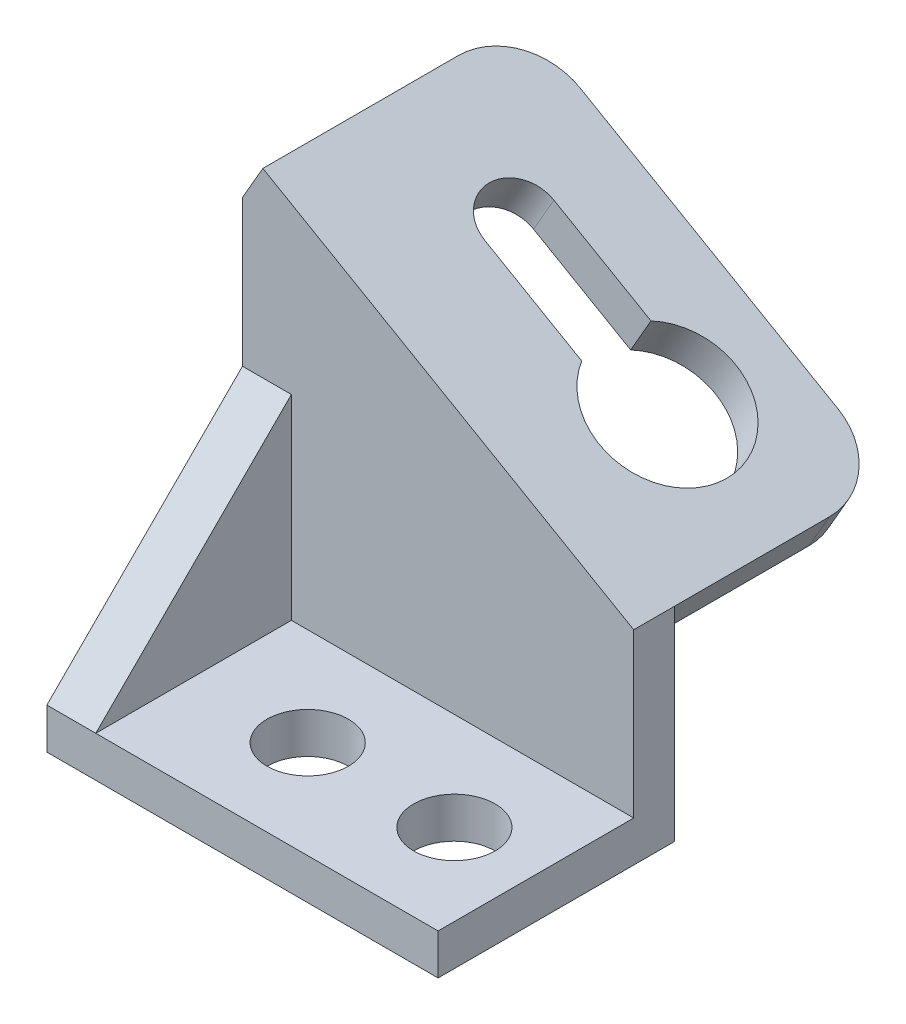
ISO-10303-21;
HEADER;
FILE_DESCRIPTION(('STEP AP214'),'2;1');
FILE_NAME('part.step','',(''),(''),'','','');
FILE_SCHEMA(('AUTOMOTIVE_DESIGN { 1 0 10303 214 1 1 1 1 }'));
ENDSEC;
DATA;
#1=APPLICATION_CONTEXT('core data for automotive mechanical design processes');
#2=APPLICATION_PROTOCOL_DEFINITION('international standard','automotive_design',2000,#1);
#3=PRODUCT_CONTEXT('',#1,'mechanical');
#4=PRODUCT('Part','Part','',(#3));
#5=PRODUCT_RELATED_PRODUCT_CATEGORY('part','',(#4));
#6=PRODUCT_DEFINITION_FORMATION('','',#4);
#7=PRODUCT_DEFINITION_CONTEXT('part definition',#1,'design');
#8=PRODUCT_DEFINITION('design','',#6,#7);
#9=PRODUCT_DEFINITION_SHAPE('','',#8);
#10=(LENGTH_UNIT() NAMED_UNIT(*) SI_UNIT(.MILLI.,.METRE.));
#11=(NAMED_UNIT(*) PLANE_ANGLE_UNIT() SI_UNIT($,.RADIAN.));
#12=(NAMED_UNIT(*) SI_UNIT($,.STERADIAN.) SOLID_ANGLE_UNIT());
#13=UNCERTAINTY_MEASURE_WITH_UNIT(LENGTH_MEASURE(1.E-05),#10,'distance_accuracy_value','');
#14=(GEOMETRIC_REPRESENTATION_CONTEXT(3) GLOBAL_UNCERTAINTY_ASSIGNED_CONTEXT((#13)) GLOBAL_UNIT_ASSIGNED_CONTEXT((#10,
#11,#12)) REPRESENTATION_CONTEXT('',''));
#15=CARTESIAN_POINT('',(0.,0.,0.));
#16=DIRECTION('',(0.,0.,1.));
#17=DIRECTION('',(1.,0.,0.));
#18=AXIS2_PLACEMENT_3D('',#15,#16,#17);
#19=CARTESIAN_POINT('',(32.7981532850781,56.8080678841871,0.));
#20=DIRECTION('',(0.500000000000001,0.866025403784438,0.));
#21=DIRECTION('',(-0.866025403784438,0.500000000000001,0.));
#22=AXIS2_PLACEMENT_3D('',#19,#20,#21);
#23=PLANE('',#22);
#24=DIRECTION('',(0.866025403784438,-0.500000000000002,0.));
#25=VECTOR('',#24,1.);
#26=CARTESIAN_POINT('',(-1.17961196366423E-13,75.7440905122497,-50.8));
#27=LINE('',#26,#25);
#28=CARTESIAN_POINT('',(14.9672726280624,67.1027316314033,-50.8));
#29=VERTEX_POINT('',#28);
#30=CARTESIAN_POINT('',(65.2014773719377,38.1,-50.8));
#31=VERTEX_POINT('',#30);
#32=EDGE_CURVE('E198',#29,#31,#27,.T.);
#33=ORIENTED_EDGE('',*,*,#32,.F.);
#34=CARTESIAN_POINT('',(14.9672726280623,67.1027316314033,-38.1));
#35=DIRECTION('',(0.500000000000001,0.866025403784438,0.));
#36=DIRECTION('',(-0.866025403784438,0.500000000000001,0.));
#37=AXIS2_PLACEMENT_3D('',#34,#35,#36);
#38=CIRCLE('',#37,12.7);
#39=CARTESIAN_POINT('',(3.96874999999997,73.4527316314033,-38.1));
#40=VERTEX_POINT('',#39);
#41=EDGE_CURVE('E270',#29,#40,#38,.T.);
#42=ORIENTED_EDGE('',*,*,#41,.T.);
#43=DIRECTION('',(0.,0.,-1.));
#44=VECTOR('',#43,1.);
#45=CARTESIAN_POINT('',(3.96874999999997,73.4527316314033,0.));
#46=LINE('',#45,#44);
#47=CARTESIAN_POINT('',(3.96874999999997,73.4527316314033,0.));
#48=VERTEX_POINT('',#47);
#49=EDGE_CURVE('E192',#48,#40,#46,.T.);
#50=ORIENTED_EDGE('',*,*,#49,.F.);
#51=DIRECTION('',(0.866025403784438,-0.500000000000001,0.));
#52=VECTOR('',#51,1.);
#53=CARTESIAN_POINT('',(-26.2151226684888,90.8793986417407,0.));
#54=LINE('',#53,#52);
#55=CARTESIAN_POINT('',(76.2,31.75,0.));
#56=VERTEX_POINT('',#55);
#57=EDGE_CURVE('E212',#48,#56,#54,.T.);
#58=ORIENTED_EDGE('',*,*,#57,.T.);
#59=DIRECTION('',(0.,0.,-1.));
#60=VECTOR('',#59,1.);
#61=CARTESIAN_POINT('',(76.2,31.75,0.));
#62=LINE('',#61,#60);
#63=CARTESIAN_POINT('',(76.2,31.75,-7.9375));
#64=VERTEX_POINT('',#63);
#65=EDGE_CURVE('E236',#56,#64,#62,.T.);
#66=ORIENTED_EDGE('',*,*,#65,.T.);
#67=DIRECTION('',(0.,0.,-1.));
#68=VECTOR('',#67,1.);
#69=CARTESIAN_POINT('',(76.2,31.75,0.));
#70=LINE('',#69,#68);
#71=CARTESIAN_POINT('',(76.2000000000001,31.75,-38.1));
#72=VERTEX_POINT('',#71);
#73=EDGE_CURVE('E195',#64,#72,#70,.T.);
#74=ORIENTED_EDGE('',*,*,#73,.T.);
#75=CARTESIAN_POINT('',(65.2014773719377,38.1,-38.1));
#76=DIRECTION('',(0.500000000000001,0.866025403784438,0.));
#77=DIRECTION('',(-0.866025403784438,0.500000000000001,0.));
#78=AXIS2_PLACEMENT_3D('',#75,#76,#77);
#79=CIRCLE('',#78,12.7);
#80=EDGE_CURVE('E268',#72,#31,#79,.T.);
#81=ORIENTED_EDGE('',*,*,#80,.T.);
#82=EDGE_LOOP('',(#33,#42,#50,#58,#66,#74,#81));
#83=FACE_BOUND('',#82,.T.);
#84=DIRECTION('',(0.866025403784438,-0.500000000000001,0.));
#85=VECTOR('',#84,1.);
#86=CARTESIAN_POINT('',(25.3318328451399,61.1187499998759,-21.828125));
#87=LINE('',#86,#85);
#88=CARTESIAN_POINT('',(25.3318328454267,61.1187499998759,-21.828125));
#89=VERTEX_POINT('',#88);
#90=CARTESIAN_POINT('',(44.2417084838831,50.2011282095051,-21.828125));
#91=VERTEX_POINT('',#90);
#92=EDGE_CURVE('E161',#89,#91,#87,.T.);
#93=ORIENTED_EDGE('',*,*,#92,.F.);
#94=CARTESIAN_POINT('',(25.3318328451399,61.1187499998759,-28.575));
#95=DIRECTION('',(-0.500000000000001,-0.866025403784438,0.));
#96=DIRECTION('',(0.866025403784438,-0.500000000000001,0.));
#97=AXIS2_PLACEMENT_3D('',#94,#95,#96);
#98=CIRCLE('',#97,6.74687499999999);
#99=CARTESIAN_POINT('',(25.3318328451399,61.1187499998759,-35.321875));
#100=VERTEX_POINT('',#99);
#101=EDGE_CURVE('E43',#89,#100,#98,.T.);
#102=ORIENTED_EDGE('',*,*,#101,.T.);
#103=DIRECTION('',(0.866025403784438,-0.500000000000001,0.));
#104=VECTOR('',#103,1.);
#105=CARTESIAN_POINT('',(25.3318328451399,61.1187499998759,-35.321875));
#106=LINE('',#105,#104);
#107=CARTESIAN_POINT('',(44.2417084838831,50.2011282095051,-35.321875));
#108=VERTEX_POINT('',#107);
#109=EDGE_CURVE('E152',#100,#108,#106,.T.);
#110=ORIENTED_EDGE('',*,*,#109,.T.);
#111=CARTESIAN_POINT('',(54.2029547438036,44.4499999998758,-28.575));
#112=DIRECTION('',(-0.500000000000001,-0.866025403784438,0.));
#113=DIRECTION('',(0.866025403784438,-0.500000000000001,0.));
#114=AXIS2_PLACEMENT_3D('',#111,#112,#113);
#115=CIRCLE('',#114,13.335);
#116=EDGE_CURVE('E158',#108,#91,#115,.T.);
#117=ORIENTED_EDGE('',*,*,#116,.T.);
#118=EDGE_LOOP('',(#93,#102,#110,#117));
#119=FACE_BOUND('',#118,.T.);
#120=ADVANCED_FACE('F28',(#83,#119),#23,.T.);
#121=CARTESIAN_POINT('',(72.23125,24.875923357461,0.));
#122=DIRECTION('',(0.500000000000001,0.866025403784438,0.));
#123=DIRECTION('',(-0.866025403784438,0.500000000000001,0.));
#124=AXIS2_PLACEMENT_3D('',#121,#122,#123);
#125=PLANE('',#124);
#126=DIRECTION('',(0.,0.,1.));
#127=VECTOR('',#126,1.);
#128=CARTESIAN_POINT('',(0.,66.5786549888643,0.));
#129=LINE('',#128,#127);
#130=CARTESIAN_POINT('',(0.,66.5786549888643,-38.1));
#131=VERTEX_POINT('',#130);
#132=CARTESIAN_POINT('',(0.,66.5786549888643,-7.9375));
#133=VERTEX_POINT('',#132);
#134=EDGE_CURVE('E255',#131,#133,#129,.T.);
#135=ORIENTED_EDGE('',*,*,#134,.F.);
#136=CARTESIAN_POINT('',(10.9985226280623,60.2286549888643,-38.1));
#137=DIRECTION('',(0.500000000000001,0.866025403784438,0.));
#138=DIRECTION('',(-0.866025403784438,0.500000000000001,0.));
#139=AXIS2_PLACEMENT_3D('',#136,#137,#138);
#140=CIRCLE('',#139,12.7);
#141=CARTESIAN_POINT('',(10.9985226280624,60.2286549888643,-50.8));
#142=VERTEX_POINT('',#141);
#143=EDGE_CURVE('E262',#131,#142,#140,.F.);
#144=ORIENTED_EDGE('',*,*,#143,.T.);
#145=DIRECTION('',(0.866025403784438,-0.500000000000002,0.));
#146=VECTOR('',#145,1.);
#147=CARTESIAN_POINT('',(-3.96875000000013,68.8700138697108,-50.8));
#148=LINE('',#147,#146);
#149=CARTESIAN_POINT('',(61.2327273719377,31.225923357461,-50.8));
#150=VERTEX_POINT('',#149);
#151=EDGE_CURVE('E204',#142,#150,#148,.T.);
#152=ORIENTED_EDGE('',*,*,#151,.T.);
#153=CARTESIAN_POINT('',(61.2327273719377,31.225923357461,-38.1));
#154=DIRECTION('',(0.500000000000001,0.866025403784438,0.));
#155=DIRECTION('',(-0.866025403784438,0.500000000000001,0.));
#156=AXIS2_PLACEMENT_3D('',#153,#154,#155);
#157=CIRCLE('',#156,12.7);
#158=CARTESIAN_POINT('',(72.23125,24.875923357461,-38.1));
#159=VERTEX_POINT('',#158);
#160=EDGE_CURVE('E260',#150,#159,#157,.F.);
#161=ORIENTED_EDGE('',*,*,#160,.T.);
#162=DIRECTION('',(0.,0.,-1.));
#163=VECTOR('',#162,1.);
#164=CARTESIAN_POINT('',(72.23125,24.875923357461,0.));
#165=LINE('',#164,#163);
#166=CARTESIAN_POINT('',(72.23125,24.875923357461,-7.9375));
#167=VERTEX_POINT('',#166);
#168=EDGE_CURVE('E201',#167,#159,#165,.T.);
#169=ORIENTED_EDGE('',*,*,#168,.F.);
#170=DIRECTION('',(0.866025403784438,-0.500000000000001,0.));
#171=VECTOR('',#170,1.);
#172=CARTESIAN_POINT('',(85.979403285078,16.938423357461,-7.9375));
#173=LINE('',#172,#171);
#174=EDGE_CURVE('E209',#133,#167,#173,.T.);
#175=ORIENTED_EDGE('',*,*,#174,.F.);
#176=EDGE_LOOP('',(#135,#144,#152,#161,#169,#175));
#177=FACE_BOUND('',#176,.T.);
#178=CARTESIAN_POINT('',(21.3630828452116,54.2446733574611,-28.575));
#179=DIRECTION('',(0.500000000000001,0.866025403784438,0.));
#180=DIRECTION('',(-0.866025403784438,0.500000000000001,0.));
#181=AXIS2_PLACEMENT_3D('',#178,#179,#180);
#182=CIRCLE('',#181,6.74687499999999);
#183=CARTESIAN_POINT('',(21.3630828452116,54.2446733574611,-21.828125));
#184=VERTEX_POINT('',#183);
#185=CARTESIAN_POINT('',(21.3630828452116,54.2446733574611,-35.321875));
#186=VERTEX_POINT('',#185);
#187=EDGE_CURVE('E11',#184,#186,#182,.F.);
#188=ORIENTED_EDGE('',*,*,#187,.F.);
#189=DIRECTION('',(0.866025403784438,-0.500000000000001,0.));
#190=VECTOR('',#189,1.);
#191=CARTESIAN_POINT('',(72.23125,24.875923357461,-21.828125));
#192=LINE('',#191,#190);
#193=CARTESIAN_POINT('',(40.2729584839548,43.3270515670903,-21.828125));
#194=VERTEX_POINT('',#193);
#195=EDGE_CURVE('E275',#184,#194,#192,.T.);
#196=ORIENTED_EDGE('',*,*,#195,.T.);
#197=CARTESIAN_POINT('',(50.2342047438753,37.5759233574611,-28.575));
#198=DIRECTION('',(0.500000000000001,0.866025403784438,0.));
#199=DIRECTION('',(-0.866025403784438,0.500000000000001,0.));
#200=AXIS2_PLACEMENT_3D('',#197,#198,#199);
#201=CIRCLE('',#200,13.335);
#202=CARTESIAN_POINT('',(40.2729584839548,43.3270515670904,-35.321875));
#203=VERTEX_POINT('',#202);
#204=EDGE_CURVE('E278',#203,#194,#201,.F.);
#205=ORIENTED_EDGE('',*,*,#204,.F.);
#206=DIRECTION('',(0.866025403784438,-0.500000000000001,0.));
#207=VECTOR('',#206,1.);
#208=CARTESIAN_POINT('',(72.23125,24.875923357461,-35.321875));
#209=LINE('',#208,#207);
#210=EDGE_CURVE('E36',#186,#203,#209,.T.);
#211=ORIENTED_EDGE('',*,*,#210,.F.);
#212=EDGE_LOOP('',(#188,#196,#205,#211));
#213=FACE_BOUND('',#212,.T.);
#214=ADVANCED_FACE('F283',(#177,#213),#125,.F.);
#215=CARTESIAN_POINT('',(76.2,0.,0.));
#216=DIRECTION('',(0.,0.,-1.));
#217=DIRECTION('',(-1.,0.,0.));
#218=AXIS2_PLACEMENT_3D('',#215,#216,#217);
#219=PLANE('',#218);
#220=DIRECTION('',(0.,-1.,0.));
#221=VECTOR('',#220,1.);
#222=CARTESIAN_POINT('',(0.,0.,0.));
#223=LINE('',#222,#221);
#224=CARTESIAN_POINT('',(0.,66.5786549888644,0.));
#225=VERTEX_POINT('',#224);
#226=CARTESIAN_POINT('',(0.,38.1,0.));
#227=VERTEX_POINT('',#226);
#228=EDGE_CURVE('E222',#225,#227,#223,.T.);
#229=ORIENTED_EDGE('',*,*,#228,.T.);
#230=DIRECTION('',(-1.,0.,0.));
#231=VECTOR('',#230,1.);
#232=CARTESIAN_POINT('',(9.525,38.1,0.));
#233=LINE('',#232,#231);
#234=CARTESIAN_POINT('',(9.525,38.1,0.));
#235=VERTEX_POINT('',#234);
#236=EDGE_CURVE('E186',#235,#227,#233,.T.);
#237=ORIENTED_EDGE('',*,*,#236,.F.);
#238=DIRECTION('',(0.,-1.,0.));
#239=VECTOR('',#238,1.);
#240=CARTESIAN_POINT('',(9.525,38.1,0.));
#241=LINE('',#240,#239);
#242=CARTESIAN_POINT('',(9.525,0.,0.));
#243=VERTEX_POINT('',#242);
#244=EDGE_CURVE('E182',#235,#243,#241,.T.);
#245=ORIENTED_EDGE('',*,*,#244,.T.);
#246=DIRECTION('',(-1.,0.,0.));
#247=VECTOR('',#246,1.);
#248=CARTESIAN_POINT('',(76.2,0.,0.));
#249=LINE('',#248,#247);
#250=CARTESIAN_POINT('',(76.2,0.,0.));
#251=VERTEX_POINT('',#250);
#252=EDGE_CURVE('E241',#251,#243,#249,.T.);
#253=ORIENTED_EDGE('',*,*,#252,.F.);
#254=DIRECTION('',(0.,-1.,0.));
#255=VECTOR('',#254,1.);
#256=CARTESIAN_POINT('',(76.2,0.,0.));
#257=LINE('',#256,#255);
#258=EDGE_CURVE('E239',#56,#251,#257,.T.);
#259=ORIENTED_EDGE('',*,*,#258,.F.);
#260=ORIENTED_EDGE('',*,*,#57,.F.);
#261=DIRECTION('',(0.5,0.866025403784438,0.));
#262=VECTOR('',#261,1.);
#263=CARTESIAN_POINT('',(0.,66.5786549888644,0.));
#264=LINE('',#263,#262);
#265=EDGE_CURVE('E188',#225,#48,#264,.T.);
#266=ORIENTED_EDGE('',*,*,#265,.F.);
#267=EDGE_LOOP('',(#229,#237,#245,#253,#259,#260,#266));
#268=FACE_BOUND('',#267,.T.);
#269=ADVANCED_FACE('F303',(#268),#219,.F.);
#270=CARTESIAN_POINT('',(-3.96875000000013,68.8700138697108,-50.8));
#271=DIRECTION('',(0.,0.,1.));
#272=DIRECTION('',(1.,0.,0.));
#273=AXIS2_PLACEMENT_3D('',#270,#271,#272);
#274=PLANE('',#273);
#275=ORIENTED_EDGE('',*,*,#151,.F.);
#276=DIRECTION('',(-0.5,-0.866025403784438,0.));
#277=VECTOR('',#276,1.);
#278=CARTESIAN_POINT('',(14.9672726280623,67.1027316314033,-50.8));
#279=LINE('',#278,#277);
#280=EDGE_CURVE('E266',#142,#29,#279,.F.);
#281=ORIENTED_EDGE('',*,*,#280,.T.);
#282=ORIENTED_EDGE('',*,*,#32,.T.);
#283=DIRECTION('',(0.500000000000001,0.866025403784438,0.));
#284=VECTOR('',#283,1.);
#285=CARTESIAN_POINT('',(61.2327273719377,31.225923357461,-50.8));
#286=LINE('',#285,#284);
#287=EDGE_CURVE('E264',#31,#150,#286,.F.);
#288=ORIENTED_EDGE('',*,*,#287,.T.);
#289=EDGE_LOOP('',(#275,#281,#282,#288));
#290=FACE_BOUND('',#289,.T.);
#291=ADVANCED_FACE('F314',(#290),#274,.F.);
#292=CARTESIAN_POINT('',(0.,0.,38.1));
#293=DIRECTION('',(-1.,0.,0.));
#294=DIRECTION('',(0.,0.,1.));
#295=AXIS2_PLACEMENT_3D('',#292,#293,#294);
#296=PLANE('',#295);
#297=ORIENTED_EDGE('',*,*,#228,.F.);
#298=DIRECTION('',(0.,0.,-1.));
#299=VECTOR('',#298,1.);
#300=CARTESIAN_POINT('',(0.,66.5786549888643,38.1));
#301=LINE('',#300,#299);
#302=EDGE_CURVE('E252',#225,#133,#301,.T.);
#303=ORIENTED_EDGE('',*,*,#302,.T.);
#304=DIRECTION('',(0.,1.,0.));
#305=VECTOR('',#304,1.);
#306=CARTESIAN_POINT('',(0.,0.,-7.9375));
#307=LINE('',#306,#305);
#308=CARTESIAN_POINT('',(0.,-7.9375,-7.9375));
#309=VERTEX_POINT('',#308);
#310=EDGE_CURVE('E220',#133,#309,#307,.F.);
#311=ORIENTED_EDGE('',*,*,#310,.T.);
#312=DIRECTION('',(0.,0.,1.));
#313=VECTOR('',#312,1.);
#314=CARTESIAN_POINT('',(0.,-7.9375,0.));
#315=LINE('',#314,#313);
#316=CARTESIAN_POINT('',(0.,-7.93749999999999,38.1));
#317=VERTEX_POINT('',#316);
#318=EDGE_CURVE('E217',#309,#317,#315,.T.);
#319=ORIENTED_EDGE('',*,*,#318,.T.);
#320=DIRECTION('',(0.,1.,0.));
#321=VECTOR('',#320,1.);
#322=CARTESIAN_POINT('',(0.,-7.93749999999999,38.1));
#323=LINE('',#322,#321);
#324=CARTESIAN_POINT('',(0.,0.,38.1));
#325=VERTEX_POINT('',#324);
#326=EDGE_CURVE('E214',#317,#325,#323,.T.);
#327=ORIENTED_EDGE('',*,*,#326,.T.);
#328=DIRECTION('',(0.,0.707106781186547,-0.707106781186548));
#329=VECTOR('',#328,1.);
#330=CARTESIAN_POINT('',(0.,0.,38.1));
#331=LINE('',#330,#329);
#332=EDGE_CURVE('E148',#325,#227,#331,.T.);
#333=ORIENTED_EDGE('',*,*,#332,.T.);
#334=EDGE_LOOP('',(#297,#303,#311,#319,#327,#333));
#335=FACE_BOUND('',#334,.T.);
#336=ADVANCED_FACE('F311',(#335),#296,.T.);
#337=CARTESIAN_POINT('',(76.2,0.,0.));
#338=DIRECTION('',(0.,-1.,0.));
#339=DIRECTION('',(0.,0.,-1.));
#340=AXIS2_PLACEMENT_3D('',#337,#338,#339);
#341=PLANE('',#340);
#342=CARTESIAN_POINT('',(31.75,0.,19.05));
#343=DIRECTION('',(0.,1.,0.));
#344=DIRECTION('',(0.,0.,1.));
#345=AXIS2_PLACEMENT_3D('',#342,#343,#344);
#346=CIRCLE('',#345,7.9375);
#347=CARTESIAN_POINT('',(31.75,0.,26.9875));
#348=VERTEX_POINT('',#347);
#349=EDGE_CURVE('E504',#348,#348,#346,.T.);
#350=ORIENTED_EDGE('',*,*,#349,.F.);
#351=EDGE_LOOP('',(#350));
#352=FACE_BOUND('',#351,.T.);
#353=CARTESIAN_POINT('',(60.325,0.,19.05));
#354=DIRECTION('',(0.,1.,0.));
#355=DIRECTION('',(0.,0.,1.));
#356=AXIS2_PLACEMENT_3D('',#353,#354,#355);
#357=CIRCLE('',#356,7.9375);
#358=CARTESIAN_POINT('',(60.325,0.,26.9875));
#359=VERTEX_POINT('',#358);
#360=EDGE_CURVE('E165',#359,#359,#357,.T.);
#361=ORIENTED_EDGE('',*,*,#360,.F.);
#362=EDGE_LOOP('',(#361));
#363=FACE_BOUND('',#362,.T.);
#364=ORIENTED_EDGE('',*,*,#252,.T.);
#365=DIRECTION('',(0.,0.,1.));
#366=VECTOR('',#365,1.);
#367=CARTESIAN_POINT('',(9.525,0.,0.));
#368=LINE('',#367,#366);
#369=CARTESIAN_POINT('',(9.525,0.,38.1));
#370=VERTEX_POINT('',#369);
#371=EDGE_CURVE('E177',#243,#370,#368,.T.);
#372=ORIENTED_EDGE('',*,*,#371,.T.);
#373=DIRECTION('',(-1.,0.,0.));
#374=VECTOR('',#373,1.);
#375=CARTESIAN_POINT('',(76.2,0.,38.1));
#376=LINE('',#375,#374);
#377=CARTESIAN_POINT('',(76.2,0.,38.1));
#378=VERTEX_POINT('',#377);
#379=EDGE_CURVE('E249',#378,#370,#376,.T.);
#380=ORIENTED_EDGE('',*,*,#379,.F.);
#381=DIRECTION('',(0.,0.,1.));
#382=VECTOR('',#381,1.);
#383=CARTESIAN_POINT('',(76.2,0.,0.));
#384=LINE('',#383,#382);
#385=EDGE_CURVE('E225',#251,#378,#384,.T.);
#386=ORIENTED_EDGE('',*,*,#385,.F.);
#387=EDGE_LOOP('',(#364,#372,#380,#386));
#388=FACE_BOUND('',#387,.T.);
#389=ADVANCED_FACE('F30',(#352,#363,#388),#341,.F.);
#390=CARTESIAN_POINT('',(76.2,-7.93749999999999,38.1));
#391=DIRECTION('',(0.,0.,1.));
#392=DIRECTION('',(1.,0.,0.));
#393=AXIS2_PLACEMENT_3D('',#390,#391,#392);
#394=PLANE('',#393);
#395=ORIENTED_EDGE('',*,*,#326,.F.);
#396=DIRECTION('',(-1.,0.,0.));
#397=VECTOR('',#396,1.);
#398=CARTESIAN_POINT('',(76.2,-7.93749999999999,38.1));
#399=LINE('',#398,#397);
#400=CARTESIAN_POINT('',(76.2,-7.93749999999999,38.1));
#401=VERTEX_POINT('',#400);
#402=EDGE_CURVE('E247',#401,#317,#399,.T.);
#403=ORIENTED_EDGE('',*,*,#402,.F.);
#404=DIRECTION('',(0.,1.,0.));
#405=VECTOR('',#404,1.);
#406=CARTESIAN_POINT('',(76.2,-7.93749999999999,38.1));
#407=LINE('',#406,#405);
#408=EDGE_CURVE('E227',#401,#378,#407,.T.);
#409=ORIENTED_EDGE('',*,*,#408,.T.);
#410=ORIENTED_EDGE('',*,*,#379,.T.);
#411=DIRECTION('',(-1.,0.,0.));
#412=VECTOR('',#411,1.);
#413=CARTESIAN_POINT('',(9.525,0.,38.1));
#414=LINE('',#413,#412);
#415=EDGE_CURVE('E185',#370,#325,#414,.T.);
#416=ORIENTED_EDGE('',*,*,#415,.T.);
#417=EDGE_LOOP('',(#395,#403,#409,#410,#416));
#418=FACE_BOUND('',#417,.T.);
#419=ADVANCED_FACE('F329',(#418),#394,.T.);
#420=CARTESIAN_POINT('',(76.2,-7.9375,0.));
#421=DIRECTION('',(0.,-1.,0.));
#422=DIRECTION('',(0.,0.,-1.));
#423=AXIS2_PLACEMENT_3D('',#420,#421,#422);
#424=PLANE('',#423);
#425=CARTESIAN_POINT('',(31.75,-7.93750000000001,19.05));
#426=DIRECTION('',(0.,1.,0.));
#427=DIRECTION('',(0.,0.,1.));
#428=AXIS2_PLACEMENT_3D('',#425,#426,#427);
#429=CIRCLE('',#428,7.9375);
#430=CARTESIAN_POINT('',(31.75,-7.9375,26.9875));
#431=VERTEX_POINT('',#430);
#432=EDGE_CURVE('E501',#431,#431,#429,.T.);
#433=ORIENTED_EDGE('',*,*,#432,.T.);
#434=EDGE_LOOP('',(#433));
#435=FACE_BOUND('',#434,.T.);
#436=CARTESIAN_POINT('',(60.325,-7.93750000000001,19.05));
#437=DIRECTION('',(0.,1.,0.));
#438=DIRECTION('',(0.,0.,1.));
#439=AXIS2_PLACEMENT_3D('',#436,#437,#438);
#440=CIRCLE('',#439,7.9375);
#441=CARTESIAN_POINT('',(60.325,-7.9375,26.9875));
#442=VERTEX_POINT('',#441);
#443=EDGE_CURVE('E162',#442,#442,#440,.T.);
#444=ORIENTED_EDGE('',*,*,#443,.T.);
#445=EDGE_LOOP('',(#444));
#446=FACE_BOUND('',#445,.T.);
#447=ORIENTED_EDGE('',*,*,#318,.F.);
#448=DIRECTION('',(-1.,0.,0.));
#449=VECTOR('',#448,1.);
#450=CARTESIAN_POINT('',(76.2,-7.9375,-7.9375));
#451=LINE('',#450,#449);
#452=CARTESIAN_POINT('',(76.2,-7.9375,-7.9375));
#453=VERTEX_POINT('',#452);
#454=EDGE_CURVE('E244',#453,#309,#451,.T.);
#455=ORIENTED_EDGE('',*,*,#454,.F.);
#456=DIRECTION('',(0.,0.,1.));
#457=VECTOR('',#456,1.);
#458=CARTESIAN_POINT('',(76.2,-7.9375,0.));
#459=LINE('',#458,#457);
#460=EDGE_CURVE('E230',#453,#401,#459,.T.);
#461=ORIENTED_EDGE('',*,*,#460,.T.);
#462=ORIENTED_EDGE('',*,*,#402,.T.);
#463=EDGE_LOOP('',(#447,#455,#461,#462));
#464=FACE_BOUND('',#463,.T.);
#465=ADVANCED_FACE('F326',(#435,#446,#464),#424,.T.);
#466=CARTESIAN_POINT('',(76.2,0.,-7.9375));
#467=DIRECTION('',(0.,0.,-1.));
#468=DIRECTION('',(-1.,0.,0.));
#469=AXIS2_PLACEMENT_3D('',#466,#467,#468);
#470=PLANE('',#469);
#471=DIRECTION('',(-0.500000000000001,-0.866025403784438,0.));
#472=VECTOR('',#471,1.);
#473=CARTESIAN_POINT('',(62.451846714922,7.93750000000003,-7.9375));
#474=LINE('',#473,#472);
#475=EDGE_CURVE('E207',#64,#167,#474,.T.);
#476=ORIENTED_EDGE('',*,*,#475,.F.);
#477=DIRECTION('',(0.,1.,0.));
#478=VECTOR('',#477,1.);
#479=CARTESIAN_POINT('',(76.2,0.,-7.9375));
#480=LINE('',#479,#478);
#481=EDGE_CURVE('E233',#64,#453,#480,.F.);
#482=ORIENTED_EDGE('',*,*,#481,.T.);
#483=ORIENTED_EDGE('',*,*,#454,.T.);
#484=ORIENTED_EDGE('',*,*,#310,.F.);
#485=ORIENTED_EDGE('',*,*,#174,.T.);
#486=EDGE_LOOP('',(#476,#482,#483,#484,#485));
#487=FACE_BOUND('',#486,.T.);
#488=ADVANCED_FACE('F319',(#487),#470,.T.);
#489=CARTESIAN_POINT('',(76.2,0.,38.1));
#490=DIRECTION('',(-1.,0.,0.));
#491=DIRECTION('',(0.,0.,1.));
#492=AXIS2_PLACEMENT_3D('',#489,#490,#491);
#493=PLANE('',#492);
#494=ORIENTED_EDGE('',*,*,#385,.T.);
#495=ORIENTED_EDGE('',*,*,#408,.F.);
#496=ORIENTED_EDGE('',*,*,#460,.F.);
#497=ORIENTED_EDGE('',*,*,#481,.F.);
#498=ORIENTED_EDGE('',*,*,#65,.F.);
#499=ORIENTED_EDGE('',*,*,#258,.T.);
#500=EDGE_LOOP('',(#494,#495,#496,#497,#498,#499));
#501=FACE_BOUND('',#500,.T.);
#502=ADVANCED_FACE('F316',(#501),#493,.F.);
#503=CARTESIAN_POINT('',(72.23125,24.875923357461,0.));
#504=DIRECTION('',(0.866025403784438,-0.500000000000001,0.));
#505=DIRECTION('',(0.500000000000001,0.866025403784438,0.));
#506=AXIS2_PLACEMENT_3D('',#503,#504,#505);
#507=PLANE('',#506);
#508=ORIENTED_EDGE('',*,*,#168,.T.);
#509=DIRECTION('',(0.500000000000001,0.866025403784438,0.));
#510=VECTOR('',#509,1.);
#511=CARTESIAN_POINT('',(76.2000000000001,31.75,-38.1));
#512=LINE('',#511,#510);
#513=EDGE_CURVE('E272',#159,#72,#512,.T.);
#514=ORIENTED_EDGE('',*,*,#513,.T.);
#515=ORIENTED_EDGE('',*,*,#73,.F.);
#516=ORIENTED_EDGE('',*,*,#475,.T.);
#517=EDGE_LOOP('',(#508,#514,#515,#516));
#518=FACE_BOUND('',#517,.T.);
#519=ADVANCED_FACE('F309',(#518),#507,.T.);
#520=CARTESIAN_POINT('',(0.,66.5786549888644,0.));
#521=DIRECTION('',(-0.866025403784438,0.5,0.));
#522=DIRECTION('',(-0.5,-0.866025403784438,0.));
#523=AXIS2_PLACEMENT_3D('',#520,#521,#522);
#524=PLANE('',#523);
#525=ORIENTED_EDGE('',*,*,#49,.T.);
#526=DIRECTION('',(-0.5,-0.866025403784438,0.));
#527=VECTOR('',#526,1.);
#528=CARTESIAN_POINT('',(0.,66.5786549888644,-38.1));
#529=LINE('',#528,#527);
#530=EDGE_CURVE('E257',#40,#131,#529,.T.);
#531=ORIENTED_EDGE('',*,*,#530,.T.);
#532=ORIENTED_EDGE('',*,*,#134,.T.);
#533=ORIENTED_EDGE('',*,*,#302,.F.);
#534=ORIENTED_EDGE('',*,*,#265,.T.);
#535=EDGE_LOOP('',(#525,#531,#532,#533,#534));
#536=FACE_BOUND('',#535,.T.);
#537=ADVANCED_FACE('F374',(#536),#524,.T.);
#538=CARTESIAN_POINT('',(10.9985226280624,60.2286549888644,-38.1));
#539=DIRECTION('',(0.5,0.866025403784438,0.));
#540=DIRECTION('',(-0.866025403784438,0.5,0.));
#541=AXIS2_PLACEMENT_3D('',#538,#539,#540);
#542=CYLINDRICAL_SURFACE('',#541,12.7);
#543=ORIENTED_EDGE('',*,*,#41,.F.);
#544=ORIENTED_EDGE('',*,*,#280,.F.);
#545=ORIENTED_EDGE('',*,*,#143,.F.);
#546=ORIENTED_EDGE('',*,*,#530,.F.);
#547=EDGE_LOOP('',(#543,#544,#545,#546));
#548=FACE_BOUND('',#547,.T.);
#549=ADVANCED_FACE('F379',(#548),#542,.T.);
#550=CARTESIAN_POINT('',(61.2327273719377,31.225923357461,-38.1));
#551=DIRECTION('',(-0.500000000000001,-0.866025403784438,0.));
#552=DIRECTION('',(0.866025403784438,-0.500000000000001,0.));
#553=AXIS2_PLACEMENT_3D('',#550,#551,#552);
#554=CYLINDRICAL_SURFACE('',#553,12.7);
#555=ORIENTED_EDGE('',*,*,#160,.F.);
#556=ORIENTED_EDGE('',*,*,#287,.F.);
#557=ORIENTED_EDGE('',*,*,#80,.F.);
#558=ORIENTED_EDGE('',*,*,#513,.F.);
#559=EDGE_LOOP('',(#555,#556,#557,#558));
#560=FACE_BOUND('',#559,.T.);
#561=ADVANCED_FACE('F357',(#560),#554,.T.);
#562=CARTESIAN_POINT('',(9.525,0.,38.1));
#563=DIRECTION('',(0.,0.707106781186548,0.707106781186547));
#564=DIRECTION('',(0.,-0.707106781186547,0.707106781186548));
#565=AXIS2_PLACEMENT_3D('',#562,#563,#564);
#566=PLANE('',#565);
#567=ORIENTED_EDGE('',*,*,#332,.F.);
#568=ORIENTED_EDGE('',*,*,#415,.F.);
#569=DIRECTION('',(0.,0.707106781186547,-0.707106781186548));
#570=VECTOR('',#569,1.);
#571=CARTESIAN_POINT('',(9.525,0.,38.1));
#572=LINE('',#571,#570);
#573=EDGE_CURVE('E180',#370,#235,#572,.T.);
#574=ORIENTED_EDGE('',*,*,#573,.T.);
#575=ORIENTED_EDGE('',*,*,#236,.T.);
#576=EDGE_LOOP('',(#567,#568,#574,#575));
#577=FACE_BOUND('',#576,.T.);
#578=ADVANCED_FACE('F371',(#577),#566,.T.);
#579=CARTESIAN_POINT('',(9.525,0.,0.));
#580=DIRECTION('',(1.,0.,0.));
#581=DIRECTION('',(0.,0.,-1.));
#582=AXIS2_PLACEMENT_3D('',#579,#580,#581);
#583=PLANE('',#582);
#584=ORIENTED_EDGE('',*,*,#371,.F.);
#585=ORIENTED_EDGE('',*,*,#244,.F.);
#586=ORIENTED_EDGE('',*,*,#573,.F.);
#587=EDGE_LOOP('',(#584,#585,#586));
#588=FACE_BOUND('',#587,.T.);
#589=ADVANCED_FACE('F369',(#588),#583,.T.);
#590=CARTESIAN_POINT('',(-10.903358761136,-1.64244288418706,-28.575));
#591=DIRECTION('',(0.500000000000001,0.866025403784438,0.));
#592=DIRECTION('',(-0.866025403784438,0.500000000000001,0.));
#593=AXIS2_PLACEMENT_3D('',#590,#591,#592);
#594=CYLINDRICAL_SURFACE('',#593,6.74687499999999);
#595=ORIENTED_EDGE('',*,*,#187,.T.);
#596=DIRECTION('',(0.500000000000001,0.866025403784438,0.));
#597=VECTOR('',#596,1.);
#598=CARTESIAN_POINT('',(-10.903358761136,-1.64244288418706,-35.321875));
#599=LINE('',#598,#597);
#600=EDGE_CURVE('E142',#186,#100,#599,.T.);
#601=ORIENTED_EDGE('',*,*,#600,.T.);
#602=ORIENTED_EDGE('',*,*,#101,.F.);
#603=DIRECTION('',(0.500000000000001,0.866025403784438,0.));
#604=VECTOR('',#603,1.);
#605=CARTESIAN_POINT('',(-10.903358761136,-1.64244288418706,-21.828125));
#606=LINE('',#605,#604);
#607=EDGE_CURVE('E171',#184,#89,#606,.T.);
#608=ORIENTED_EDGE('',*,*,#607,.F.);
#609=EDGE_LOOP('',(#595,#601,#602,#608));
#610=FACE_BOUND('',#609,.T.);
#611=ADVANCED_FACE('F144',(#610),#594,.F.);
#612=CARTESIAN_POINT('',(-10.903358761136,-1.64244288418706,-35.321875));
#613=DIRECTION('',(0.,0.,1.));
#614=DIRECTION('',(1.,0.,0.));
#615=AXIS2_PLACEMENT_3D('',#612,#613,#614);
#616=PLANE('',#615);
#617=ORIENTED_EDGE('',*,*,#210,.T.);
#618=DIRECTION('',(0.500000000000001,0.866025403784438,0.));
#619=VECTOR('',#618,1.);
#620=CARTESIAN_POINT('',(8.00651687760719,-12.5600646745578,-35.321875));
#621=LINE('',#620,#619);
#622=EDGE_CURVE('E149',#203,#108,#621,.T.);
#623=ORIENTED_EDGE('',*,*,#622,.T.);
#624=ORIENTED_EDGE('',*,*,#109,.F.);
#625=ORIENTED_EDGE('',*,*,#600,.F.);
#626=EDGE_LOOP('',(#617,#623,#624,#625));
#627=FACE_BOUND('',#626,.T.);
#628=ADVANCED_FACE('F153',(#627),#616,.T.);
#629=CARTESIAN_POINT('',(17.9677631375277,-18.3111928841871,-28.575));
#630=DIRECTION('',(0.500000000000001,0.866025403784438,0.));
#631=DIRECTION('',(-0.866025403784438,0.500000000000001,0.));
#632=AXIS2_PLACEMENT_3D('',#629,#630,#631);
#633=CYLINDRICAL_SURFACE('',#632,13.335);
#634=ORIENTED_EDGE('',*,*,#204,.T.);
#635=DIRECTION('',(0.500000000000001,0.866025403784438,0.));
#636=VECTOR('',#635,1.);
#637=CARTESIAN_POINT('',(8.0065168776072,-12.5600646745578,-21.828125));
#638=LINE('',#637,#636);
#639=EDGE_CURVE('E51',#194,#91,#638,.T.);
#640=ORIENTED_EDGE('',*,*,#639,.T.);
#641=ORIENTED_EDGE('',*,*,#116,.F.);
#642=ORIENTED_EDGE('',*,*,#622,.F.);
#643=EDGE_LOOP('',(#634,#640,#641,#642));
#644=FACE_BOUND('',#643,.T.);
#645=ADVANCED_FACE('F282',(#644),#633,.F.);
#646=CARTESIAN_POINT('',(-10.903358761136,-1.64244288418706,-21.828125));
#647=DIRECTION('',(0.,0.,1.));
#648=DIRECTION('',(1.,0.,0.));
#649=AXIS2_PLACEMENT_3D('',#646,#647,#648);
#650=PLANE('',#649);
#651=ORIENTED_EDGE('',*,*,#607,.T.);
#652=ORIENTED_EDGE('',*,*,#92,.T.);
#653=ORIENTED_EDGE('',*,*,#639,.F.);
#654=ORIENTED_EDGE('',*,*,#195,.F.);
#655=EDGE_LOOP('',(#651,#652,#653,#654));
#656=FACE_BOUND('',#655,.T.);
#657=ADVANCED_FACE('F284',(#656),#650,.F.);
#658=CARTESIAN_POINT('',(60.325,-7.93750000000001,19.05));
#659=DIRECTION('',(0.,1.,0.));
#660=DIRECTION('',(0.,0.,1.));
#661=AXIS2_PLACEMENT_3D('',#658,#659,#660);
#662=CYLINDRICAL_SURFACE('',#661,7.9375);
#663=ORIENTED_EDGE('',*,*,#443,.F.);
#664=EDGE_LOOP('',(#663));
#665=FACE_BOUND('',#664,.T.);
#666=ORIENTED_EDGE('',*,*,#360,.T.);
#667=EDGE_LOOP('',(#666));
#668=FACE_BOUND('',#667,.T.);
#669=ADVANCED_FACE('F286',(#665,#668),#662,.F.);
#670=CARTESIAN_POINT('',(31.75,-7.93750000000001,19.05));
#671=DIRECTION('',(0.,1.,0.));
#672=DIRECTION('',(0.,0.,1.));
#673=AXIS2_PLACEMENT_3D('',#670,#671,#672);
#674=CYLINDRICAL_SURFACE('',#673,7.9375);
#675=ORIENTED_EDGE('',*,*,#432,.F.);
#676=EDGE_LOOP('',(#675));
#677=FACE_BOUND('',#676,.T.);
#678=ORIENTED_EDGE('',*,*,#349,.T.);
#679=EDGE_LOOP('',(#678));
#680=FACE_BOUND('',#679,.T.);
#681=ADVANCED_FACE('F292',(#677,#680),#674,.F.);
#682=CLOSED_SHELL('',(#120,#214,#269,#291,#336,#389,#419,#465,#488,#502,#519,#537,#549,#561,
#578,#589,#611,#628,#645,#657,#669,#681));
#683=MANIFOLD_SOLID_BREP('B2',#682);
#684=ADVANCED_BREP_SHAPE_REPRESENTATION('',(#18,#683),#14);
#685=SHAPE_DEFINITION_REPRESENTATION(#9,#684);
ENDSEC;
END-ISO-10303-21;
